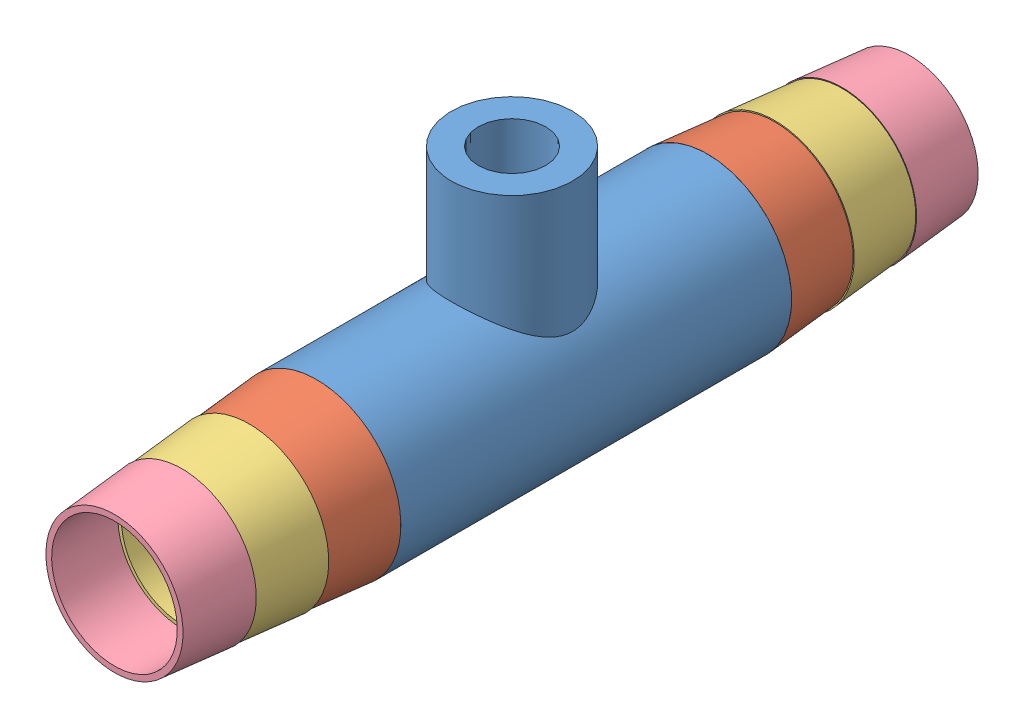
SolidWorks assembly Assemblagefinale.SLDASM, configuration Défaut (file format 12000). Lengths in mm.
Overall size (22.52 25.26 59).
9 component instances, 4 part files, 2 mates.
Components (placement in the parent):
- T-1: T.SLDPRT [Défaut] at (0.3669 -16.824 50) size (12.5 20.25 29)
- Embout-1: Embout.SLDASM [Défaut] at (-19.9857 -2.2285 81.8456) x (0.532971 0.846133 0) z (0.846133 -0.532971 0) size (16.33 15 16.33)
  - P1-1: P1.SLDPRT [Défaut] at (-1.5024 -2.8456 25) size (12.5 5 12.5)
  - P2-1: P2.SLDPRT [Défaut] at (-1.5024 2.1544 25) x (-0.837169 0 -0.546944) z (0 1 0) size (11.8 11.8 5)
  - P3-1: P3.SLDPRT [Défaut] at (-1.5024 7.1544 25) x (-0.837169 0 -0.546944) z (0 1 0) size (11.05 11.05 5)
- Embout-2: Embout.SLDASM [Défaut] at (-24.671 -17.4272 47.1544) x (-0.035932 -0.999354 0) z (0.999354 -0.035932 0) size (16.33 15 16.33)
  - P1-1: P1.SLDPRT [Défaut] at (-1.5024 -2.8456 25) size (12.5 5 12.5)
  - P2-1: P2.SLDPRT [Défaut] at (-1.5024 2.1544 25) x (-0.837169 0 -0.546944) z (0 1 0) size (11.8 11.8 5)
  - P3-1: P3.SLDPRT [Défaut] at (-1.5024 7.1544 25) x (-0.837169 0 -0.546944) z (0 1 0) size (11.05 11.05 5)
Mates (geometry in assembly coordinates):
- Coïncidente1: coincident aligned: circle of T-1; circle of Embout-1/P1-1
- Coïncidente2: coincident anti-aligned: circle of T-1; circle of Embout-2/P1-1
